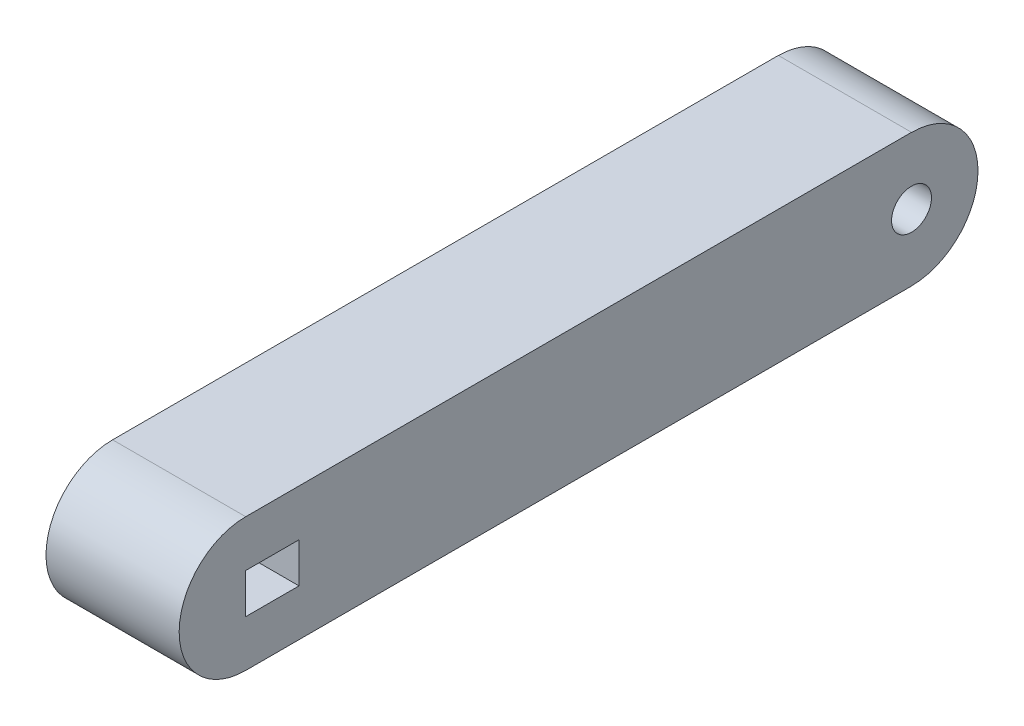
ISO-10303-21;
HEADER;
FILE_DESCRIPTION(('STEP AP214'),'2;1');
FILE_NAME('part.step','',(''),(''),'','','');
FILE_SCHEMA(('AUTOMOTIVE_DESIGN { 1 0 10303 214 1 1 1 1 }'));
ENDSEC;
DATA;
#1=APPLICATION_CONTEXT('core data for automotive mechanical design processes');
#2=APPLICATION_PROTOCOL_DEFINITION('international standard','automotive_design',2000,#1);
#3=PRODUCT_CONTEXT('',#1,'mechanical');
#4=PRODUCT('Part','Part','',(#3));
#5=PRODUCT_RELATED_PRODUCT_CATEGORY('part','',(#4));
#6=PRODUCT_DEFINITION_FORMATION('','',#4);
#7=PRODUCT_DEFINITION_CONTEXT('part definition',#1,'design');
#8=PRODUCT_DEFINITION('design','',#6,#7);
#9=PRODUCT_DEFINITION_SHAPE('','',#8);
#10=(LENGTH_UNIT() NAMED_UNIT(*) SI_UNIT(.MILLI.,.METRE.));
#11=(NAMED_UNIT(*) PLANE_ANGLE_UNIT() SI_UNIT($,.RADIAN.));
#12=(NAMED_UNIT(*) SI_UNIT($,.STERADIAN.) SOLID_ANGLE_UNIT());
#13=UNCERTAINTY_MEASURE_WITH_UNIT(LENGTH_MEASURE(1.E-05),#10,'distance_accuracy_value','');
#14=(GEOMETRIC_REPRESENTATION_CONTEXT(3) GLOBAL_UNCERTAINTY_ASSIGNED_CONTEXT((#13)) GLOBAL_UNIT_ASSIGNED_CONTEXT((#10,
#11,#12)) REPRESENTATION_CONTEXT('',''));
#15=CARTESIAN_POINT('',(0.,0.,0.));
#16=DIRECTION('',(0.,0.,1.));
#17=DIRECTION('',(1.,0.,0.));
#18=AXIS2_PLACEMENT_3D('',#15,#16,#17);
#19=CARTESIAN_POINT('',(25.4,12.7,-63.5000000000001));
#20=DIRECTION('',(0.,0.,1.));
#21=DIRECTION('',(1.,0.,0.));
#22=AXIS2_PLACEMENT_3D('',#19,#20,#21);
#23=PLANE('',#22);
#24=DIRECTION('',(0.,1.,0.));
#25=VECTOR('',#24,1.);
#26=CARTESIAN_POINT('',(0.,12.7,-63.5000000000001));
#27=LINE('',#26,#25);
#28=CARTESIAN_POINT('',(0.,-12.7,-63.5000000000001));
#29=VERTEX_POINT('',#28);
#30=CARTESIAN_POINT('',(0.,-12.6812964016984,-63.5000000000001));
#31=VERTEX_POINT('',#30);
#32=EDGE_CURVE('E180',#29,#31,#27,.T.);
#33=ORIENTED_EDGE('',*,*,#32,.T.);
#34=DIRECTION('',(1.,0.,0.));
#35=VECTOR('',#34,1.);
#36=CARTESIAN_POINT('',(0.,-12.6812964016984,-63.5000000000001));
#37=LINE('',#36,#35);
#38=CARTESIAN_POINT('',(25.4,-12.6812964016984,-63.5000000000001));
#39=VERTEX_POINT('',#38);
#40=EDGE_CURVE('E161',#31,#39,#37,.T.);
#41=ORIENTED_EDGE('',*,*,#40,.T.);
#42=DIRECTION('',(0.,1.,0.));
#43=VECTOR('',#42,1.);
#44=CARTESIAN_POINT('',(25.4,12.7,-63.5000000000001));
#45=LINE('',#44,#43);
#46=CARTESIAN_POINT('',(25.4,-12.7,-63.5000000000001));
#47=VERTEX_POINT('',#46);
#48=EDGE_CURVE('E170',#47,#39,#45,.T.);
#49=ORIENTED_EDGE('',*,*,#48,.F.);
#50=DIRECTION('',(-1.,0.,0.));
#51=VECTOR('',#50,1.);
#52=CARTESIAN_POINT('',(25.4,-12.7,-63.5000000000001));
#53=LINE('',#52,#51);
#54=EDGE_CURVE('E179',#47,#29,#53,.T.);
#55=ORIENTED_EDGE('',*,*,#54,.T.);
#56=EDGE_LOOP('',(#33,#41,#49,#55));
#57=FACE_BOUND('',#56,.T.);
#58=ADVANCED_FACE('F35',(#57),#23,.F.);
#59=CARTESIAN_POINT('',(25.4,12.6812964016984,-63.5000000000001));
#60=VERTEX_POINT('',#59);
#61=CARTESIAN_POINT('',(25.4,12.7,-63.5000000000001));
#62=VERTEX_POINT('',#61);
#63=EDGE_CURVE('E174',#60,#62,#45,.T.);
#64=ORIENTED_EDGE('',*,*,#63,.F.);
#65=DIRECTION('',(1.,0.,0.));
#66=VECTOR('',#65,1.);
#67=CARTESIAN_POINT('',(0.,12.6812964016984,-63.5000000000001));
#68=LINE('',#67,#66);
#69=CARTESIAN_POINT('',(0.,12.6812964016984,-63.5000000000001));
#70=VERTEX_POINT('',#69);
#71=EDGE_CURVE('E157',#60,#70,#68,.F.);
#72=ORIENTED_EDGE('',*,*,#71,.T.);
#73=CARTESIAN_POINT('',(0.,12.7,-63.5000000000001));
#74=VERTEX_POINT('',#73);
#75=EDGE_CURVE('E168',#70,#74,#27,.T.);
#76=ORIENTED_EDGE('',*,*,#75,.T.);
#77=DIRECTION('',(-1.,0.,0.));
#78=VECTOR('',#77,1.);
#79=CARTESIAN_POINT('',(25.4,12.7,-63.5000000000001));
#80=LINE('',#79,#78);
#81=EDGE_CURVE('E11',#62,#74,#80,.T.);
#82=ORIENTED_EDGE('',*,*,#81,.F.);
#83=EDGE_LOOP('',(#64,#72,#76,#82));
#84=FACE_BOUND('',#83,.T.);
#85=ADVANCED_FACE('F37',(#84),#23,.F.);
#86=CARTESIAN_POINT('',(25.4,12.7,63.4999999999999));
#87=DIRECTION('',(0.,-1.,0.));
#88=DIRECTION('',(0.,0.,-1.));
#89=AXIS2_PLACEMENT_3D('',#86,#87,#88);
#90=PLANE('',#89);
#91=DIRECTION('',(0.,0.,1.));
#92=VECTOR('',#91,1.);
#93=CARTESIAN_POINT('',(0.,12.7,63.4999999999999));
#94=LINE('',#93,#92);
#95=CARTESIAN_POINT('',(0.,12.7,63.4999999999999));
#96=VERTEX_POINT('',#95);
#97=EDGE_CURVE('E183',#74,#96,#94,.T.);
#98=ORIENTED_EDGE('',*,*,#97,.T.);
#99=DIRECTION('',(-1.,0.,0.));
#100=VECTOR('',#99,1.);
#101=CARTESIAN_POINT('',(25.4,12.7,63.4999999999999));
#102=LINE('',#101,#100);
#103=CARTESIAN_POINT('',(25.4,12.7,63.4999999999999));
#104=VERTEX_POINT('',#103);
#105=EDGE_CURVE('E43',#104,#96,#102,.T.);
#106=ORIENTED_EDGE('',*,*,#105,.F.);
#107=DIRECTION('',(0.,0.,1.));
#108=VECTOR('',#107,1.);
#109=CARTESIAN_POINT('',(25.4,12.7,63.4999999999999));
#110=LINE('',#109,#108);
#111=EDGE_CURVE('E173',#62,#104,#110,.T.);
#112=ORIENTED_EDGE('',*,*,#111,.F.);
#113=ORIENTED_EDGE('',*,*,#81,.T.);
#114=EDGE_LOOP('',(#98,#106,#112,#113));
#115=FACE_BOUND('',#114,.T.);
#116=ADVANCED_FACE('F203',(#115),#90,.F.);
#117=CARTESIAN_POINT('',(25.4,-12.7,63.4999999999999));
#118=DIRECTION('',(0.,1.,0.));
#119=DIRECTION('',(0.,0.,1.));
#120=AXIS2_PLACEMENT_3D('',#117,#118,#119);
#121=PLANE('',#120);
#122=DIRECTION('',(0.,0.,-1.));
#123=VECTOR('',#122,1.);
#124=CARTESIAN_POINT('',(0.,-12.7,63.4999999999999));
#125=LINE('',#124,#123);
#126=CARTESIAN_POINT('',(0.,-12.7,63.4999999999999));
#127=VERTEX_POINT('',#126);
#128=EDGE_CURVE('E186',#127,#29,#125,.T.);
#129=ORIENTED_EDGE('',*,*,#128,.T.);
#130=ORIENTED_EDGE('',*,*,#54,.F.);
#131=DIRECTION('',(0.,0.,-1.));
#132=VECTOR('',#131,1.);
#133=CARTESIAN_POINT('',(25.4,-12.7,63.4999999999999));
#134=LINE('',#133,#132);
#135=CARTESIAN_POINT('',(25.4,-12.7,63.4999999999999));
#136=VERTEX_POINT('',#135);
#137=EDGE_CURVE('E177',#136,#47,#134,.T.);
#138=ORIENTED_EDGE('',*,*,#137,.F.);
#139=DIRECTION('',(-1.,0.,0.));
#140=VECTOR('',#139,1.);
#141=CARTESIAN_POINT('',(25.4,-12.7,63.4999999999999));
#142=LINE('',#141,#140);
#143=EDGE_CURVE('E190',#136,#127,#142,.T.);
#144=ORIENTED_EDGE('',*,*,#143,.T.);
#145=EDGE_LOOP('',(#129,#130,#138,#144));
#146=FACE_BOUND('',#145,.T.);
#147=ADVANCED_FACE('F215',(#146),#121,.F.);
#148=CARTESIAN_POINT('',(25.4,0.,0.));
#149=DIRECTION('',(1.,0.,0.));
#150=DIRECTION('',(0.,0.,-1.));
#151=AXIS2_PLACEMENT_3D('',#148,#149,#150);
#152=PLANE('',#151);
#153=DIRECTION('',(0.,-1.,0.));
#154=VECTOR('',#153,1.);
#155=CARTESIAN_POINT('',(25.4,-3.81,63.4999999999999));
#156=LINE('',#155,#154);
#157=CARTESIAN_POINT('',(25.4,3.81,63.4999999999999));
#158=VERTEX_POINT('',#157);
#159=CARTESIAN_POINT('',(25.4,-3.81,63.4999999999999));
#160=VERTEX_POINT('',#159);
#161=EDGE_CURVE('E50',#158,#160,#156,.T.);
#162=ORIENTED_EDGE('',*,*,#161,.F.);
#163=DIRECTION('',(0.,0.,1.));
#164=VECTOR('',#163,1.);
#165=CARTESIAN_POINT('',(25.4,3.81,63.4999999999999));
#166=LINE('',#165,#164);
#167=CARTESIAN_POINT('',(25.4,3.81,53.3399999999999));
#168=VERTEX_POINT('',#167);
#169=EDGE_CURVE('E130',#168,#158,#166,.T.);
#170=ORIENTED_EDGE('',*,*,#169,.F.);
#171=DIRECTION('',(0.,1.,0.));
#172=VECTOR('',#171,1.);
#173=CARTESIAN_POINT('',(25.4,-3.81,53.3399999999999));
#174=LINE('',#173,#172);
#175=CARTESIAN_POINT('',(25.4,-3.81,53.3399999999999));
#176=VERTEX_POINT('',#175);
#177=EDGE_CURVE('E133',#176,#168,#174,.T.);
#178=ORIENTED_EDGE('',*,*,#177,.F.);
#179=DIRECTION('',(0.,0.,-1.));
#180=VECTOR('',#179,1.);
#181=CARTESIAN_POINT('',(25.4,-3.81,63.4999999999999));
#182=LINE('',#181,#180);
#183=EDGE_CURVE('E139',#160,#176,#182,.T.);
#184=ORIENTED_EDGE('',*,*,#183,.F.);
#185=EDGE_LOOP('',(#162,#170,#178,#184));
#186=FACE_BOUND('',#185,.T.);
#187=CARTESIAN_POINT('',(25.4,0.,-63.5000000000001));
#188=DIRECTION('',(1.,0.,0.));
#189=DIRECTION('',(0.,0.,-1.));
#190=AXIS2_PLACEMENT_3D('',#187,#188,#189);
#191=CIRCLE('',#190,3.81);
#192=CARTESIAN_POINT('',(25.4,0.,-67.31));
#193=VERTEX_POINT('',#192);
#194=EDGE_CURVE('E145',#193,#193,#191,.T.);
#195=ORIENTED_EDGE('',*,*,#194,.F.);
#196=EDGE_LOOP('',(#195));
#197=FACE_BOUND('',#196,.T.);
#198=ORIENTED_EDGE('',*,*,#48,.T.);
#199=CARTESIAN_POINT('',(25.4,0.,-63.5000000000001));
#200=DIRECTION('',(1.,0.,0.));
#201=DIRECTION('',(0.,0.,-1.));
#202=AXIS2_PLACEMENT_3D('',#199,#200,#201);
#203=CIRCLE('',#202,12.6812964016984);
#204=EDGE_CURVE('E152',#39,#60,#203,.T.);
#205=ORIENTED_EDGE('',*,*,#204,.T.);
#206=ORIENTED_EDGE('',*,*,#63,.T.);
#207=ORIENTED_EDGE('',*,*,#111,.T.);
#208=CARTESIAN_POINT('',(25.4,0.,63.4999999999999));
#209=DIRECTION('',(1.,0.,0.));
#210=DIRECTION('',(0.,0.,-1.));
#211=AXIS2_PLACEMENT_3D('',#208,#209,#210);
#212=CIRCLE('',#211,12.7);
#213=EDGE_CURVE('E165',#104,#136,#212,.T.);
#214=ORIENTED_EDGE('',*,*,#213,.T.);
#215=ORIENTED_EDGE('',*,*,#137,.T.);
#216=EDGE_LOOP('',(#198,#205,#206,#207,#214,#215));
#217=FACE_BOUND('',#216,.T.);
#218=ADVANCED_FACE('F217',(#186,#197,#217),#152,.T.);
#219=CARTESIAN_POINT('',(0.,0.,0.));
#220=DIRECTION('',(1.,0.,0.));
#221=DIRECTION('',(0.,0.,-1.));
#222=AXIS2_PLACEMENT_3D('',#219,#220,#221);
#223=PLANE('',#222);
#224=DIRECTION('',(0.,0.,1.));
#225=VECTOR('',#224,1.);
#226=CARTESIAN_POINT('',(0.,3.81,63.4999999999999));
#227=LINE('',#226,#225);
#228=CARTESIAN_POINT('',(0.,3.81,53.3399999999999));
#229=VERTEX_POINT('',#228);
#230=CARTESIAN_POINT('',(0.,3.81,63.4999999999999));
#231=VERTEX_POINT('',#230);
#232=EDGE_CURVE('E120',#229,#231,#227,.T.);
#233=ORIENTED_EDGE('',*,*,#232,.T.);
#234=DIRECTION('',(0.,-1.,0.));
#235=VECTOR('',#234,1.);
#236=CARTESIAN_POINT('',(0.,-3.81,63.4999999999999));
#237=LINE('',#236,#235);
#238=CARTESIAN_POINT('',(0.,-3.81,63.4999999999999));
#239=VERTEX_POINT('',#238);
#240=EDGE_CURVE('E114',#231,#239,#237,.T.);
#241=ORIENTED_EDGE('',*,*,#240,.T.);
#242=DIRECTION('',(0.,0.,-1.));
#243=VECTOR('',#242,1.);
#244=CARTESIAN_POINT('',(0.,-3.81,63.4999999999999));
#245=LINE('',#244,#243);
#246=CARTESIAN_POINT('',(0.,-3.81,53.3399999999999));
#247=VERTEX_POINT('',#246);
#248=EDGE_CURVE('E123',#239,#247,#245,.T.);
#249=ORIENTED_EDGE('',*,*,#248,.T.);
#250=DIRECTION('',(0.,1.,0.));
#251=VECTOR('',#250,1.);
#252=CARTESIAN_POINT('',(0.,-3.81,53.3399999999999));
#253=LINE('',#252,#251);
#254=EDGE_CURVE('E58',#247,#229,#253,.T.);
#255=ORIENTED_EDGE('',*,*,#254,.T.);
#256=EDGE_LOOP('',(#233,#241,#249,#255));
#257=FACE_BOUND('',#256,.T.);
#258=CARTESIAN_POINT('',(0.,0.,-63.5000000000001));
#259=DIRECTION('',(1.,0.,0.));
#260=DIRECTION('',(0.,0.,-1.));
#261=AXIS2_PLACEMENT_3D('',#258,#259,#260);
#262=CIRCLE('',#261,3.81);
#263=CARTESIAN_POINT('',(0.,0.,-67.31));
#264=VERTEX_POINT('',#263);
#265=EDGE_CURVE('E149',#264,#264,#262,.T.);
#266=ORIENTED_EDGE('',*,*,#265,.T.);
#267=EDGE_LOOP('',(#266));
#268=FACE_BOUND('',#267,.T.);
#269=ORIENTED_EDGE('',*,*,#75,.F.);
#270=CARTESIAN_POINT('',(0.,0.,-63.5000000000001));
#271=DIRECTION('',(1.,0.,0.));
#272=DIRECTION('',(0.,0.,-1.));
#273=AXIS2_PLACEMENT_3D('',#270,#271,#272);
#274=CIRCLE('',#273,12.6812964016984);
#275=EDGE_CURVE('E155',#31,#70,#274,.T.);
#276=ORIENTED_EDGE('',*,*,#275,.F.);
#277=ORIENTED_EDGE('',*,*,#32,.F.);
#278=ORIENTED_EDGE('',*,*,#128,.F.);
#279=CARTESIAN_POINT('',(0.,0.,63.4999999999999));
#280=DIRECTION('',(1.,0.,0.));
#281=DIRECTION('',(0.,0.,-1.));
#282=AXIS2_PLACEMENT_3D('',#279,#280,#281);
#283=CIRCLE('',#282,12.7);
#284=EDGE_CURVE('E164',#96,#127,#283,.T.);
#285=ORIENTED_EDGE('',*,*,#284,.F.);
#286=ORIENTED_EDGE('',*,*,#97,.F.);
#287=EDGE_LOOP('',(#269,#276,#277,#278,#285,#286));
#288=FACE_BOUND('',#287,.T.);
#289=ADVANCED_FACE('F127',(#257,#268,#288),#223,.F.);
#290=CARTESIAN_POINT('',(25.4,0.,63.4999999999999));
#291=DIRECTION('',(-1.,0.,0.));
#292=DIRECTION('',(0.,0.,1.));
#293=AXIS2_PLACEMENT_3D('',#290,#291,#292);
#294=CYLINDRICAL_SURFACE('',#293,12.7);
#295=ORIENTED_EDGE('',*,*,#213,.F.);
#296=ORIENTED_EDGE('',*,*,#105,.T.);
#297=ORIENTED_EDGE('',*,*,#284,.T.);
#298=ORIENTED_EDGE('',*,*,#143,.F.);
#299=EDGE_LOOP('',(#295,#296,#297,#298));
#300=FACE_BOUND('',#299,.T.);
#301=ADVANCED_FACE('F195',(#300),#294,.T.);
#302=CARTESIAN_POINT('',(0.,0.,-63.5000000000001));
#303=DIRECTION('',(1.,0.,0.));
#304=DIRECTION('',(0.,0.,-1.));
#305=AXIS2_PLACEMENT_3D('',#302,#303,#304);
#306=CYLINDRICAL_SURFACE('',#305,12.6812964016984);
#307=ORIENTED_EDGE('',*,*,#40,.F.);
#308=ORIENTED_EDGE('',*,*,#275,.T.);
#309=ORIENTED_EDGE('',*,*,#71,.F.);
#310=ORIENTED_EDGE('',*,*,#204,.F.);
#311=EDGE_LOOP('',(#307,#308,#309,#310));
#312=FACE_BOUND('',#311,.T.);
#313=ADVANCED_FACE('F218',(#312),#306,.T.);
#314=CARTESIAN_POINT('',(0.,0.,-63.5000000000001));
#315=DIRECTION('',(1.,0.,0.));
#316=DIRECTION('',(0.,0.,-1.));
#317=AXIS2_PLACEMENT_3D('',#314,#315,#316);
#318=CYLINDRICAL_SURFACE('',#317,3.81);
#319=ORIENTED_EDGE('',*,*,#265,.F.);
#320=EDGE_LOOP('',(#319));
#321=FACE_BOUND('',#320,.T.);
#322=ORIENTED_EDGE('',*,*,#194,.T.);
#323=EDGE_LOOP('',(#322));
#324=FACE_BOUND('',#323,.T.);
#325=ADVANCED_FACE('F220',(#321,#324),#318,.F.);
#326=CARTESIAN_POINT('',(0.,-3.81,63.4999999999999));
#327=DIRECTION('',(0.,0.,1.));
#328=DIRECTION('',(1.,0.,0.));
#329=AXIS2_PLACEMENT_3D('',#326,#327,#328);
#330=PLANE('',#329);
#331=ORIENTED_EDGE('',*,*,#161,.T.);
#332=DIRECTION('',(1.,0.,0.));
#333=VECTOR('',#332,1.);
#334=CARTESIAN_POINT('',(0.,-3.81,63.4999999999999));
#335=LINE('',#334,#333);
#336=EDGE_CURVE('E110',#239,#160,#335,.T.);
#337=ORIENTED_EDGE('',*,*,#336,.F.);
#338=ORIENTED_EDGE('',*,*,#240,.F.);
#339=DIRECTION('',(1.,0.,0.));
#340=VECTOR('',#339,1.);
#341=CARTESIAN_POINT('',(0.,3.81,63.4999999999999));
#342=LINE('',#341,#340);
#343=EDGE_CURVE('E143',#231,#158,#342,.T.);
#344=ORIENTED_EDGE('',*,*,#343,.T.);
#345=EDGE_LOOP('',(#331,#337,#338,#344));
#346=FACE_BOUND('',#345,.T.);
#347=ADVANCED_FACE('F112',(#346),#330,.F.);
#348=CARTESIAN_POINT('',(0.,3.81,63.4999999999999));
#349=DIRECTION('',(0.,1.,0.));
#350=DIRECTION('',(0.,0.,1.));
#351=AXIS2_PLACEMENT_3D('',#348,#349,#350);
#352=PLANE('',#351);
#353=ORIENTED_EDGE('',*,*,#169,.T.);
#354=ORIENTED_EDGE('',*,*,#343,.F.);
#355=ORIENTED_EDGE('',*,*,#232,.F.);
#356=DIRECTION('',(1.,0.,0.));
#357=VECTOR('',#356,1.);
#358=CARTESIAN_POINT('',(0.,3.81,53.3399999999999));
#359=LINE('',#358,#357);
#360=EDGE_CURVE('E146',#229,#168,#359,.T.);
#361=ORIENTED_EDGE('',*,*,#360,.T.);
#362=EDGE_LOOP('',(#353,#354,#355,#361));
#363=FACE_BOUND('',#362,.T.);
#364=ADVANCED_FACE('F254',(#363),#352,.F.);
#365=CARTESIAN_POINT('',(0.,-3.81,53.3399999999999));
#366=DIRECTION('',(0.,0.,-1.));
#367=DIRECTION('',(-1.,0.,0.));
#368=AXIS2_PLACEMENT_3D('',#365,#366,#367);
#369=PLANE('',#368);
#370=ORIENTED_EDGE('',*,*,#177,.T.);
#371=ORIENTED_EDGE('',*,*,#360,.F.);
#372=ORIENTED_EDGE('',*,*,#254,.F.);
#373=DIRECTION('',(1.,0.,0.));
#374=VECTOR('',#373,1.);
#375=CARTESIAN_POINT('',(0.,-3.81,53.3399999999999));
#376=LINE('',#375,#374);
#377=EDGE_CURVE('E119',#247,#176,#376,.T.);
#378=ORIENTED_EDGE('',*,*,#377,.T.);
#379=EDGE_LOOP('',(#370,#371,#372,#378));
#380=FACE_BOUND('',#379,.T.);
#381=ADVANCED_FACE('F252',(#380),#369,.F.);
#382=CARTESIAN_POINT('',(0.,-3.81,63.4999999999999));
#383=DIRECTION('',(0.,-1.,0.));
#384=DIRECTION('',(0.,0.,-1.));
#385=AXIS2_PLACEMENT_3D('',#382,#383,#384);
#386=PLANE('',#385);
#387=ORIENTED_EDGE('',*,*,#183,.T.);
#388=ORIENTED_EDGE('',*,*,#377,.F.);
#389=ORIENTED_EDGE('',*,*,#248,.F.);
#390=ORIENTED_EDGE('',*,*,#336,.T.);
#391=EDGE_LOOP('',(#387,#388,#389,#390));
#392=FACE_BOUND('',#391,.T.);
#393=ADVANCED_FACE('F124',(#392),#386,.F.);
#394=CLOSED_SHELL('',(#58,#85,#116,#147,#218,#289,#301,#313,#325,#347,#364,#381,#393));
#395=MANIFOLD_SOLID_BREP('B2',#394);
#396=ADVANCED_BREP_SHAPE_REPRESENTATION('',(#18,#395),#14);
#397=SHAPE_DEFINITION_REPRESENTATION(#9,#396);
ENDSEC;
END-ISO-10303-21;
